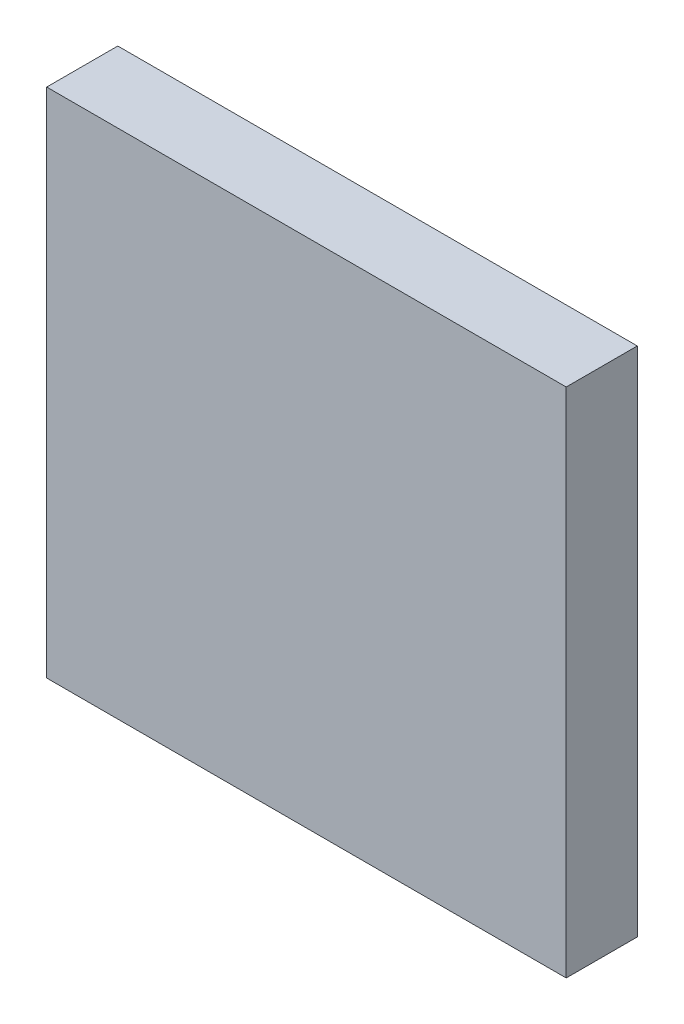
ISO-10303-21;
HEADER;
FILE_DESCRIPTION(('STEP AP214'),'2;1');
FILE_NAME('part.step','',(''),(''),'','','');
FILE_SCHEMA(('AUTOMOTIVE_DESIGN { 1 0 10303 214 1 1 1 1 }'));
ENDSEC;
DATA;
#1=APPLICATION_CONTEXT('core data for automotive mechanical design processes');
#2=APPLICATION_PROTOCOL_DEFINITION('international standard','automotive_design',2000,#1);
#3=PRODUCT_CONTEXT('',#1,'mechanical');
#4=PRODUCT('Part','Part','',(#3));
#5=PRODUCT_RELATED_PRODUCT_CATEGORY('part','',(#4));
#6=PRODUCT_DEFINITION_FORMATION('','',#4);
#7=PRODUCT_DEFINITION_CONTEXT('part definition',#1,'design');
#8=PRODUCT_DEFINITION('design','',#6,#7);
#9=PRODUCT_DEFINITION_SHAPE('','',#8);
#10=(LENGTH_UNIT() NAMED_UNIT(*) SI_UNIT(.MILLI.,.METRE.));
#11=(NAMED_UNIT(*) PLANE_ANGLE_UNIT() SI_UNIT($,.RADIAN.));
#12=(NAMED_UNIT(*) SI_UNIT($,.STERADIAN.) SOLID_ANGLE_UNIT());
#13=UNCERTAINTY_MEASURE_WITH_UNIT(LENGTH_MEASURE(1.E-05),#10,'distance_accuracy_value','');
#14=(GEOMETRIC_REPRESENTATION_CONTEXT(3) GLOBAL_UNCERTAINTY_ASSIGNED_CONTEXT((#13)) GLOBAL_UNIT_ASSIGNED_CONTEXT((#10,
#11,#12)) REPRESENTATION_CONTEXT('',''));
#15=CARTESIAN_POINT('',(0.,0.,0.));
#16=DIRECTION('',(0.,0.,1.));
#17=DIRECTION('',(1.,0.,0.));
#18=AXIS2_PLACEMENT_3D('',#15,#16,#17);
#19=CARTESIAN_POINT('',(-26.8203106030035,17.3271859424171,5.));
#20=DIRECTION('',(1.,0.,0.));
#21=DIRECTION('',(0.,1.,0.));
#22=AXIS2_PLACEMENT_3D('',#19,#20,#21);
#23=PLANE('',#22);
#24=DIRECTION('',(0.,-1.,0.));
#25=VECTOR('',#24,1.);
#26=CARTESIAN_POINT('',(-26.8203106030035,17.3271859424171,0.));
#27=LINE('',#26,#25);
#28=CARTESIAN_POINT('',(-26.8203106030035,17.3271859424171,0.));
#29=VERTEX_POINT('',#28);
#30=CARTESIAN_POINT('',(-26.8203106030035,-18.6728140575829,0.));
#31=VERTEX_POINT('',#30);
#32=EDGE_CURVE('E96',#29,#31,#27,.T.);
#33=ORIENTED_EDGE('',*,*,#32,.T.);
#34=DIRECTION('',(0.,0.,-1.));
#35=VECTOR('',#34,1.);
#36=CARTESIAN_POINT('',(-26.8203106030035,-18.6728140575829,5.));
#37=LINE('',#36,#35);
#38=CARTESIAN_POINT('',(-26.8203106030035,-18.6728140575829,5.));
#39=VERTEX_POINT('',#38);
#40=EDGE_CURVE('E11',#39,#31,#37,.T.);
#41=ORIENTED_EDGE('',*,*,#40,.F.);
#42=DIRECTION('',(0.,-1.,0.));
#43=VECTOR('',#42,1.);
#44=CARTESIAN_POINT('',(-26.8203106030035,17.3271859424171,5.));
#45=LINE('',#44,#43);
#46=CARTESIAN_POINT('',(-26.8203106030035,17.3271859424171,5.));
#47=VERTEX_POINT('',#46);
#48=EDGE_CURVE('E84',#47,#39,#45,.T.);
#49=ORIENTED_EDGE('',*,*,#48,.F.);
#50=DIRECTION('',(0.,0.,-1.));
#51=VECTOR('',#50,1.);
#52=CARTESIAN_POINT('',(-26.8203106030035,17.3271859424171,5.));
#53=LINE('',#52,#51);
#54=EDGE_CURVE('E92',#47,#29,#53,.T.);
#55=ORIENTED_EDGE('',*,*,#54,.T.);
#56=EDGE_LOOP('',(#33,#41,#49,#55));
#57=FACE_BOUND('',#56,.T.);
#58=ADVANCED_FACE('F33',(#57),#23,.F.);
#59=CARTESIAN_POINT('',(-26.8203106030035,-18.6728140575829,5.));
#60=DIRECTION('',(0.,1.,0.));
#61=DIRECTION('',(0.,0.,1.));
#62=AXIS2_PLACEMENT_3D('',#59,#60,#61);
#63=PLANE('',#62);
#64=DIRECTION('',(1.,0.,0.));
#65=VECTOR('',#64,1.);
#66=CARTESIAN_POINT('',(-26.8203106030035,-18.6728140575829,0.));
#67=LINE('',#66,#65);
#68=CARTESIAN_POINT('',(9.7196893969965,-18.6728140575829,0.));
#69=VERTEX_POINT('',#68);
#70=EDGE_CURVE('E88',#31,#69,#67,.T.);
#71=ORIENTED_EDGE('',*,*,#70,.T.);
#72=DIRECTION('',(0.,0.,-1.));
#73=VECTOR('',#72,1.);
#74=CARTESIAN_POINT('',(9.7196893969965,-18.6728140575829,5.));
#75=LINE('',#74,#73);
#76=CARTESIAN_POINT('',(9.7196893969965,-18.6728140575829,5.));
#77=VERTEX_POINT('',#76);
#78=EDGE_CURVE('E41',#77,#69,#75,.T.);
#79=ORIENTED_EDGE('',*,*,#78,.F.);
#80=DIRECTION('',(1.,0.,0.));
#81=VECTOR('',#80,1.);
#82=CARTESIAN_POINT('',(-26.8203106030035,-18.6728140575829,5.));
#83=LINE('',#82,#81);
#84=EDGE_CURVE('E79',#39,#77,#83,.T.);
#85=ORIENTED_EDGE('',*,*,#84,.F.);
#86=ORIENTED_EDGE('',*,*,#40,.T.);
#87=EDGE_LOOP('',(#71,#79,#85,#86));
#88=FACE_BOUND('',#87,.T.);
#89=ADVANCED_FACE('F87',(#88),#63,.F.);
#90=CARTESIAN_POINT('',(9.71968939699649,17.3271859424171,5.));
#91=DIRECTION('',(-1.,0.,0.));
#92=DIRECTION('',(0.,-1.,0.));
#93=AXIS2_PLACEMENT_3D('',#90,#91,#92);
#94=PLANE('',#93);
#95=DIRECTION('',(0.,1.,0.));
#96=VECTOR('',#95,1.);
#97=CARTESIAN_POINT('',(9.71968939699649,17.3271859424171,0.));
#98=LINE('',#97,#96);
#99=CARTESIAN_POINT('',(9.71968939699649,17.3271859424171,0.));
#100=VERTEX_POINT('',#99);
#101=EDGE_CURVE('E66',#69,#100,#98,.T.);
#102=ORIENTED_EDGE('',*,*,#101,.T.);
#103=DIRECTION('',(0.,0.,-1.));
#104=VECTOR('',#103,1.);
#105=CARTESIAN_POINT('',(9.71968939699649,17.3271859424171,5.));
#106=LINE('',#105,#104);
#107=CARTESIAN_POINT('',(9.71968939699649,17.3271859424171,5.));
#108=VERTEX_POINT('',#107);
#109=EDGE_CURVE('E89',#108,#100,#106,.T.);
#110=ORIENTED_EDGE('',*,*,#109,.F.);
#111=DIRECTION('',(0.,1.,0.));
#112=VECTOR('',#111,1.);
#113=CARTESIAN_POINT('',(9.71968939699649,17.3271859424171,5.));
#114=LINE('',#113,#112);
#115=EDGE_CURVE('E82',#77,#108,#114,.T.);
#116=ORIENTED_EDGE('',*,*,#115,.F.);
#117=ORIENTED_EDGE('',*,*,#78,.T.);
#118=EDGE_LOOP('',(#102,#110,#116,#117));
#119=FACE_BOUND('',#118,.T.);
#120=ADVANCED_FACE('F90',(#119),#94,.F.);
#121=CARTESIAN_POINT('',(-26.8203106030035,17.3271859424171,5.));
#122=DIRECTION('',(0.,-1.,0.));
#123=DIRECTION('',(1.,0.,0.));
#124=AXIS2_PLACEMENT_3D('',#121,#122,#123);
#125=PLANE('',#124);
#126=DIRECTION('',(-1.,0.,0.));
#127=VECTOR('',#126,1.);
#128=CARTESIAN_POINT('',(-26.8203106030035,17.3271859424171,0.));
#129=LINE('',#128,#127);
#130=EDGE_CURVE('E72',#100,#29,#129,.T.);
#131=ORIENTED_EDGE('',*,*,#130,.T.);
#132=ORIENTED_EDGE('',*,*,#54,.F.);
#133=DIRECTION('',(-1.,0.,0.));
#134=VECTOR('',#133,1.);
#135=CARTESIAN_POINT('',(-26.8203106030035,17.3271859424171,5.));
#136=LINE('',#135,#134);
#137=EDGE_CURVE('E49',#108,#47,#136,.T.);
#138=ORIENTED_EDGE('',*,*,#137,.F.);
#139=ORIENTED_EDGE('',*,*,#109,.T.);
#140=EDGE_LOOP('',(#131,#132,#138,#139));
#141=FACE_BOUND('',#140,.T.);
#142=ADVANCED_FACE('F103',(#141),#125,.F.);
#143=CARTESIAN_POINT('',(0.,0.,5.));
#144=DIRECTION('',(0.,0.,1.));
#145=DIRECTION('',(1.,0.,0.));
#146=AXIS2_PLACEMENT_3D('',#143,#144,#145);
#147=PLANE('',#146);
#148=ORIENTED_EDGE('',*,*,#48,.T.);
#149=ORIENTED_EDGE('',*,*,#84,.T.);
#150=ORIENTED_EDGE('',*,*,#115,.T.);
#151=ORIENTED_EDGE('',*,*,#137,.T.);
#152=EDGE_LOOP('',(#148,#149,#150,#151));
#153=FACE_BOUND('',#152,.T.);
#154=ADVANCED_FACE('F80',(#153),#147,.T.);
#155=CARTESIAN_POINT('',(0.,0.,0.));
#156=DIRECTION('',(0.,0.,1.));
#157=DIRECTION('',(1.,0.,0.));
#158=AXIS2_PLACEMENT_3D('',#155,#156,#157);
#159=PLANE('',#158);
#160=ORIENTED_EDGE('',*,*,#32,.F.);
#161=ORIENTED_EDGE('',*,*,#130,.F.);
#162=ORIENTED_EDGE('',*,*,#101,.F.);
#163=ORIENTED_EDGE('',*,*,#70,.F.);
#164=EDGE_LOOP('',(#160,#161,#162,#163));
#165=FACE_BOUND('',#164,.T.);
#166=ADVANCED_FACE('F106',(#165),#159,.F.);
#167=CLOSED_SHELL('',(#58,#89,#120,#142,#154,#166));
#168=MANIFOLD_SOLID_BREP('B2',#167);
#169=ADVANCED_BREP_SHAPE_REPRESENTATION('',(#18,#168),#14);
#170=SHAPE_DEFINITION_REPRESENTATION(#9,#169);
ENDSEC;
END-ISO-10303-21;
